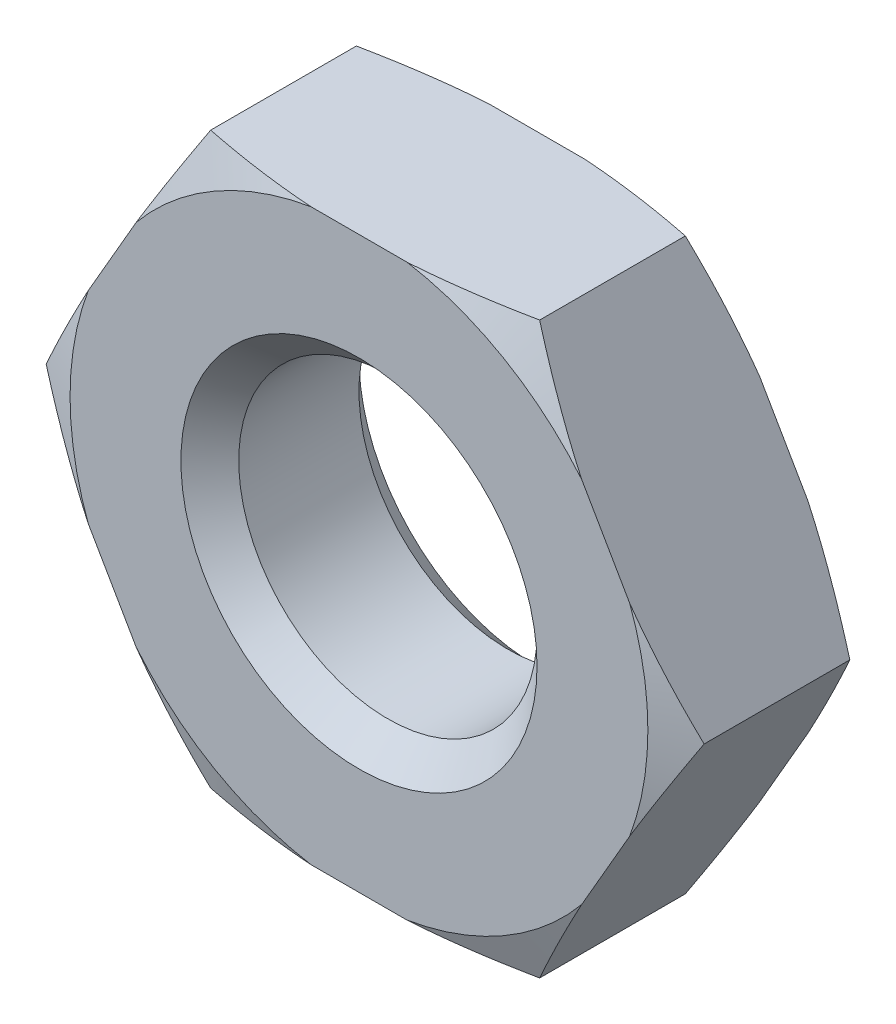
ISO-10303-21;
HEADER;
FILE_DESCRIPTION(('STEP AP214'),'2;1');
FILE_NAME('part.step','',(''),(''),'','','');
FILE_SCHEMA(('AUTOMOTIVE_DESIGN { 1 0 10303 214 1 1 1 1 }'));
ENDSEC;
DATA;
#1=APPLICATION_CONTEXT('core data for automotive mechanical design processes');
#2=APPLICATION_PROTOCOL_DEFINITION('international standard','automotive_design',2000,#1);
#3=PRODUCT_CONTEXT('',#1,'mechanical');
#4=PRODUCT('Part','Part','',(#3));
#5=PRODUCT_RELATED_PRODUCT_CATEGORY('part','',(#4));
#6=PRODUCT_DEFINITION_FORMATION('','',#4);
#7=PRODUCT_DEFINITION_CONTEXT('part definition',#1,'design');
#8=PRODUCT_DEFINITION('design','',#6,#7);
#9=PRODUCT_DEFINITION_SHAPE('','',#8);
#10=(LENGTH_UNIT() NAMED_UNIT(*) SI_UNIT(.MILLI.,.METRE.));
#11=(NAMED_UNIT(*) PLANE_ANGLE_UNIT() SI_UNIT($,.RADIAN.));
#12=(NAMED_UNIT(*) SI_UNIT($,.STERADIAN.) SOLID_ANGLE_UNIT());
#13=UNCERTAINTY_MEASURE_WITH_UNIT(LENGTH_MEASURE(1.E-05),#10,'distance_accuracy_value','');
#14=(GEOMETRIC_REPRESENTATION_CONTEXT(3) GLOBAL_UNCERTAINTY_ASSIGNED_CONTEXT((#13)) GLOBAL_UNIT_ASSIGNED_CONTEXT((#10,
#11,#12)) REPRESENTATION_CONTEXT('',''));
#15=CARTESIAN_POINT('',(0.,0.,0.));
#16=DIRECTION('',(0.,0.,1.));
#17=DIRECTION('',(1.,0.,0.));
#18=AXIS2_PLACEMENT_3D('',#15,#16,#17);
#19=CARTESIAN_POINT('',(0.,0.,4.77272727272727));
#20=DIRECTION('',(0.,0.,-1.));
#21=DIRECTION('',(1.,0.,0.));
#22=AXIS2_PLACEMENT_3D('',#19,#20,#21);
#23=CONICAL_SURFACE('',#22,8.67508026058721,1.18682389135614);
#24=CARTESIAN_POINT('',(4.6188,7.99999626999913,4.54545454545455));
#25=CARTESIAN_POINT('',(2.87668249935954,7.99999626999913,4.89738512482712));
#26=CARTESIAN_POINT('',(1.34673601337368,7.99999626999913,5.));
#27=(BOUNDED_CURVE() B_SPLINE_CURVE(2,(#24,#25,#26),.UNSPECIFIED.,.F.,
.F.) B_SPLINE_CURVE_WITH_KNOTS((3,3),(0.,3.30531398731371),
.UNSPECIFIED.) CURVE() GEOMETRIC_REPRESENTATION_ITEM() RATIONAL_B_SPLINE_CURVE((1.,
1.01827193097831,1.)) REPRESENTATION_ITEM(''));
#28=CARTESIAN_POINT('',(4.6188,7.99999626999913,4.54545454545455));
#29=VERTEX_POINT('',#28);
#30=CARTESIAN_POINT('',(1.34673601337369,7.99999626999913,5.));
#31=VERTEX_POINT('',#30);
#32=EDGE_CURVE('E10',#29,#31,#27,.T.);
#33=ORIENTED_EDGE('',*,*,#32,.T.);
#34=CARTESIAN_POINT('',(0.,0.,5.));
#35=DIRECTION('',(0.,0.,-1.));
#36=DIRECTION('',(1.,0.,0.));
#37=AXIS2_PLACEMENT_3D('',#34,#35,#36);
#38=CIRCLE('',#37,8.11256052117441);
#39=CARTESIAN_POINT('',(6.25483199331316,5.16630573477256,5.));
#40=VERTEX_POINT('',#39);
#41=EDGE_CURVE('E25',#31,#40,#38,.T.);
#42=ORIENTED_EDGE('',*,*,#41,.T.);
#43=CARTESIAN_POINT('',(6.25483199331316,5.16630573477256,5.));
#44=CARTESIAN_POINT('',(5.48985875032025,6.49127825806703,4.89738512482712));
#45=CARTESIAN_POINT('',(4.6188,7.99999626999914,4.54545454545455));
#46=(BOUNDED_CURVE() B_SPLINE_CURVE(2,(#43,#44,#45),.UNSPECIFIED.,.F.,
.F.) B_SPLINE_CURVE_WITH_KNOTS((3,3),(0.,3.30531398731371),
.UNSPECIFIED.) CURVE() GEOMETRIC_REPRESENTATION_ITEM() RATIONAL_B_SPLINE_CURVE((1.,
1.01827193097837,1.)) REPRESENTATION_ITEM(''));
#47=EDGE_CURVE('E273',#40,#29,#46,.T.);
#48=ORIENTED_EDGE('',*,*,#47,.T.);
#49=EDGE_LOOP('',(#33,#42,#48));
#50=FACE_BOUND('',#49,.T.);
#51=ADVANCED_FACE('F15',(#50),#23,.T.);
#52=CARTESIAN_POINT('',(0.,0.,4.77272727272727));
#53=DIRECTION('',(0.,0.,-1.));
#54=DIRECTION('',(1.,0.,0.));
#55=AXIS2_PLACEMENT_3D('',#52,#53,#54);
#56=CONICAL_SURFACE('',#55,8.67508026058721,1.18682389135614);
#57=CARTESIAN_POINT('',(-4.6188,7.99999626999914,4.54545454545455));
#58=CARTESIAN_POINT('',(-5.48985875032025,6.49127825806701,4.89738512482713));
#59=CARTESIAN_POINT('',(-6.25483199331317,5.16630573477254,5.));
#60=(BOUNDED_CURVE() B_SPLINE_CURVE(2,(#57,#58,#59),.UNSPECIFIED.,.F.,
.F.) B_SPLINE_CURVE_WITH_KNOTS((3,3),(0.,3.30531398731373),
.UNSPECIFIED.) CURVE() GEOMETRIC_REPRESENTATION_ITEM() RATIONAL_B_SPLINE_CURVE((1.,
1.01827193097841,1.)) REPRESENTATION_ITEM(''));
#61=CARTESIAN_POINT('',(-4.6188,7.99999626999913,4.54545454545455));
#62=VERTEX_POINT('',#61);
#63=CARTESIAN_POINT('',(-6.25483199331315,5.16630573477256,5.));
#64=VERTEX_POINT('',#63);
#65=EDGE_CURVE('E240',#62,#64,#60,.T.);
#66=ORIENTED_EDGE('',*,*,#65,.T.);
#67=CARTESIAN_POINT('',(0.,0.,5.));
#68=DIRECTION('',(0.,0.,-1.));
#69=DIRECTION('',(1.,0.,0.));
#70=AXIS2_PLACEMENT_3D('',#67,#68,#69);
#71=CIRCLE('',#70,8.11256052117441);
#72=CARTESIAN_POINT('',(-1.34673601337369,7.99999626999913,5.));
#73=VERTEX_POINT('',#72);
#74=EDGE_CURVE('E218',#64,#73,#71,.T.);
#75=ORIENTED_EDGE('',*,*,#74,.T.);
#76=CARTESIAN_POINT('',(-1.34673601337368,7.99999626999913,5.));
#77=CARTESIAN_POINT('',(-2.87668249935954,7.99999626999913,4.89738512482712));
#78=CARTESIAN_POINT('',(-4.6188,7.99999626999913,4.54545454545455));
#79=(BOUNDED_CURVE() B_SPLINE_CURVE(2,(#76,#77,#78),.UNSPECIFIED.,.F.,
.F.) B_SPLINE_CURVE_WITH_KNOTS((3,3),(0.,3.30531398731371),
.UNSPECIFIED.) CURVE() GEOMETRIC_REPRESENTATION_ITEM() RATIONAL_B_SPLINE_CURVE((1.,
1.01827193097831,1.)) REPRESENTATION_ITEM(''));
#80=EDGE_CURVE('E213',#73,#62,#79,.T.);
#81=ORIENTED_EDGE('',*,*,#80,.T.);
#82=EDGE_LOOP('',(#66,#75,#81));
#83=FACE_BOUND('',#82,.T.);
#84=ADVANCED_FACE('F471',(#83),#56,.T.);
#85=CARTESIAN_POINT('',(0.,0.,4.77272727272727));
#86=DIRECTION('',(0.,0.,-1.));
#87=DIRECTION('',(1.,0.,0.));
#88=AXIS2_PLACEMENT_3D('',#85,#86,#87);
#89=CONICAL_SURFACE('',#88,8.67508026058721,1.18682389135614);
#90=CARTESIAN_POINT('',(7.60156800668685,-2.83369053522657,5.));
#91=CARTESIAN_POINT('',(8.36654124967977,-1.50871801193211,4.89738512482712));
#92=CARTESIAN_POINT('',(9.2376,0.,4.54545454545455));
#93=(BOUNDED_CURVE() B_SPLINE_CURVE(2,(#90,#91,#92),.UNSPECIFIED.,.F.,
.F.) B_SPLINE_CURVE_WITH_KNOTS((3,3),(0.,3.30531398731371),
.UNSPECIFIED.) CURVE() GEOMETRIC_REPRESENTATION_ITEM() RATIONAL_B_SPLINE_CURVE((1.,
1.01827193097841,1.)) REPRESENTATION_ITEM(''));
#94=CARTESIAN_POINT('',(7.60156800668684,-2.83369053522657,5.));
#95=VERTEX_POINT('',#94);
#96=CARTESIAN_POINT('',(9.2376,0.,4.54545454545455));
#97=VERTEX_POINT('',#96);
#98=EDGE_CURVE('E219',#95,#97,#93,.T.);
#99=ORIENTED_EDGE('',*,*,#98,.T.);
#100=CARTESIAN_POINT('',(9.2376,0.,4.54545454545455));
#101=CARTESIAN_POINT('',(8.36654124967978,1.50871801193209,4.89738512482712));
#102=CARTESIAN_POINT('',(7.60156800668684,2.83369053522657,5.));
#103=(BOUNDED_CURVE() B_SPLINE_CURVE(2,(#100,#101,#102),.UNSPECIFIED.,.F.,
.F.) B_SPLINE_CURVE_WITH_KNOTS((3,3),(0.,3.30531398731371),
.UNSPECIFIED.) CURVE() GEOMETRIC_REPRESENTATION_ITEM() RATIONAL_B_SPLINE_CURVE((1.,
1.01827193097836,1.)) REPRESENTATION_ITEM(''));
#104=CARTESIAN_POINT('',(7.60156800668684,2.83369053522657,5.));
#105=VERTEX_POINT('',#104);
#106=EDGE_CURVE('E247',#97,#105,#103,.T.);
#107=ORIENTED_EDGE('',*,*,#106,.T.);
#108=CARTESIAN_POINT('',(0.,0.,5.));
#109=DIRECTION('',(0.,0.,-1.));
#110=DIRECTION('',(1.,0.,0.));
#111=AXIS2_PLACEMENT_3D('',#108,#109,#110);
#112=CIRCLE('',#111,8.11256052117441);
#113=EDGE_CURVE('E297',#105,#95,#112,.T.);
#114=ORIENTED_EDGE('',*,*,#113,.T.);
#115=EDGE_LOOP('',(#99,#107,#114));
#116=FACE_BOUND('',#115,.T.);
#117=ADVANCED_FACE('F477',(#116),#89,.T.);
#118=CARTESIAN_POINT('',(0.,0.,4.77272727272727));
#119=DIRECTION('',(0.,0.,-1.));
#120=DIRECTION('',(1.,0.,0.));
#121=AXIS2_PLACEMENT_3D('',#118,#119,#120);
#122=CONICAL_SURFACE('',#121,8.67508026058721,1.18682389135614);
#123=CARTESIAN_POINT('',(-9.2376,0.,4.54545454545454));
#124=CARTESIAN_POINT('',(-8.36654124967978,-1.50871801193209,4.89738512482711));
#125=CARTESIAN_POINT('',(-7.60156800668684,-2.83369053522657,5.));
#126=(BOUNDED_CURVE() B_SPLINE_CURVE(2,(#123,#124,#125),.UNSPECIFIED.,.F.,
.F.) B_SPLINE_CURVE_WITH_KNOTS((3,3),(0.,3.30531398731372),
.UNSPECIFIED.) CURVE() GEOMETRIC_REPRESENTATION_ITEM() RATIONAL_B_SPLINE_CURVE((1.,
1.01827193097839,1.)) REPRESENTATION_ITEM(''));
#127=CARTESIAN_POINT('',(-9.2376,0.,4.54545454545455));
#128=VERTEX_POINT('',#127);
#129=CARTESIAN_POINT('',(-7.60156800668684,-2.83369053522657,5.));
#130=VERTEX_POINT('',#129);
#131=EDGE_CURVE('E262',#128,#130,#126,.T.);
#132=ORIENTED_EDGE('',*,*,#131,.T.);
#133=CARTESIAN_POINT('',(0.,0.,5.));
#134=DIRECTION('',(0.,0.,-1.));
#135=DIRECTION('',(1.,0.,0.));
#136=AXIS2_PLACEMENT_3D('',#133,#134,#135);
#137=CIRCLE('',#136,8.11256052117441);
#138=CARTESIAN_POINT('',(-7.60156800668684,2.83369053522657,5.));
#139=VERTEX_POINT('',#138);
#140=EDGE_CURVE('E260',#130,#139,#137,.T.);
#141=ORIENTED_EDGE('',*,*,#140,.T.);
#142=CARTESIAN_POINT('',(-7.60156800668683,2.83369053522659,5.));
#143=CARTESIAN_POINT('',(-8.36654124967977,1.50871801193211,4.89738512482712));
#144=CARTESIAN_POINT('',(-9.2376,0.,4.54545454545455));
#145=(BOUNDED_CURVE() B_SPLINE_CURVE(2,(#142,#143,#144),.UNSPECIFIED.,.F.,
.F.) B_SPLINE_CURVE_WITH_KNOTS((3,3),(0.,3.30531398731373),
.UNSPECIFIED.) CURVE() GEOMETRIC_REPRESENTATION_ITEM() RATIONAL_B_SPLINE_CURVE((1.,
1.01827193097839,1.)) REPRESENTATION_ITEM(''));
#146=EDGE_CURVE('E263',#139,#128,#145,.T.);
#147=ORIENTED_EDGE('',*,*,#146,.T.);
#148=EDGE_LOOP('',(#132,#141,#147));
#149=FACE_BOUND('',#148,.T.);
#150=ADVANCED_FACE('F489',(#149),#122,.T.);
#151=CARTESIAN_POINT('',(0.,0.,4.77272727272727));
#152=DIRECTION('',(0.,0.,-1.));
#153=DIRECTION('',(1.,0.,0.));
#154=AXIS2_PLACEMENT_3D('',#151,#152,#153);
#155=CONICAL_SURFACE('',#154,8.67508026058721,1.18682389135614);
#156=CARTESIAN_POINT('',(1.3467360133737,-7.99999626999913,5.));
#157=CARTESIAN_POINT('',(2.87668249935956,-7.99999626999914,4.89738512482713));
#158=CARTESIAN_POINT('',(4.6188,-7.99999626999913,4.54545454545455));
#159=(BOUNDED_CURVE() B_SPLINE_CURVE(2,(#156,#157,#158),.UNSPECIFIED.,.F.,
.F.) B_SPLINE_CURVE_WITH_KNOTS((3,3),(0.,3.3053139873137),
.UNSPECIFIED.) CURVE() GEOMETRIC_REPRESENTATION_ITEM() RATIONAL_B_SPLINE_CURVE((1.,
1.0182719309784,1.)) REPRESENTATION_ITEM(''));
#160=CARTESIAN_POINT('',(1.34673601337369,-7.99999626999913,5.));
#161=VERTEX_POINT('',#160);
#162=CARTESIAN_POINT('',(4.6188,-7.99999626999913,4.54545454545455));
#163=VERTEX_POINT('',#162);
#164=EDGE_CURVE('E323',#161,#163,#159,.T.);
#165=ORIENTED_EDGE('',*,*,#164,.T.);
#166=CARTESIAN_POINT('',(4.6188,-7.99999626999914,4.54545454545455));
#167=CARTESIAN_POINT('',(5.48985875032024,-6.49127825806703,4.89738512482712));
#168=CARTESIAN_POINT('',(6.25483199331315,-5.16630573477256,5.));
#169=(BOUNDED_CURVE() B_SPLINE_CURVE(2,(#166,#167,#168),.UNSPECIFIED.,.F.,
.F.) B_SPLINE_CURVE_WITH_KNOTS((3,3),(0.,3.30531398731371),
.UNSPECIFIED.) CURVE() GEOMETRIC_REPRESENTATION_ITEM() RATIONAL_B_SPLINE_CURVE((1.,
1.01827193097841,1.)) REPRESENTATION_ITEM(''));
#170=CARTESIAN_POINT('',(6.25483199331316,-5.16630573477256,5.));
#171=VERTEX_POINT('',#170);
#172=EDGE_CURVE('E336',#163,#171,#169,.T.);
#173=ORIENTED_EDGE('',*,*,#172,.T.);
#174=CARTESIAN_POINT('',(0.,0.,5.));
#175=DIRECTION('',(0.,0.,-1.));
#176=DIRECTION('',(1.,0.,0.));
#177=AXIS2_PLACEMENT_3D('',#174,#175,#176);
#178=CIRCLE('',#177,8.11256052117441);
#179=EDGE_CURVE('E205',#171,#161,#178,.T.);
#180=ORIENTED_EDGE('',*,*,#179,.T.);
#181=EDGE_LOOP('',(#165,#173,#180));
#182=FACE_BOUND('',#181,.T.);
#183=ADVANCED_FACE('F397',(#182),#155,.T.);
#184=CARTESIAN_POINT('',(0.,0.,0.227272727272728));
#185=DIRECTION('',(0.,0.,1.));
#186=DIRECTION('',(1.,0.,0.));
#187=AXIS2_PLACEMENT_3D('',#184,#185,#186);
#188=CONICAL_SURFACE('',#187,8.67508026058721,1.18682389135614);
#189=CARTESIAN_POINT('',(4.6188,7.99999626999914,0.454545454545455));
#190=CARTESIAN_POINT('',(5.48985875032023,6.49127825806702,0.10261487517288));
#191=CARTESIAN_POINT('',(6.25483199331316,5.16630573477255,0.));
#192=(BOUNDED_CURVE() B_SPLINE_CURVE(2,(#189,#190,#191),.UNSPECIFIED.,.F.,
.F.) B_SPLINE_CURVE_WITH_KNOTS((3,3),(0.,3.30531398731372),
.UNSPECIFIED.) CURVE() GEOMETRIC_REPRESENTATION_ITEM() RATIONAL_B_SPLINE_CURVE((1.,
1.01827193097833,1.)) REPRESENTATION_ITEM(''));
#193=CARTESIAN_POINT('',(4.6188,7.99999626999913,0.454545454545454));
#194=VERTEX_POINT('',#193);
#195=CARTESIAN_POINT('',(6.25483199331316,5.16630573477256,0.));
#196=VERTEX_POINT('',#195);
#197=EDGE_CURVE('E197',#194,#196,#192,.T.);
#198=ORIENTED_EDGE('',*,*,#197,.T.);
#199=CARTESIAN_POINT('',(0.,0.,0.));
#200=DIRECTION('',(0.,0.,1.));
#201=DIRECTION('',(1.,0.,0.));
#202=AXIS2_PLACEMENT_3D('',#199,#200,#201);
#203=CIRCLE('',#202,8.11256052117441);
#204=CARTESIAN_POINT('',(1.34673601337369,7.99999626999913,0.));
#205=VERTEX_POINT('',#204);
#206=EDGE_CURVE('E206',#196,#205,#203,.T.);
#207=ORIENTED_EDGE('',*,*,#206,.T.);
#208=CARTESIAN_POINT('',(1.3467360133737,7.99999626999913,0.));
#209=CARTESIAN_POINT('',(2.87668249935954,7.99999626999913,0.102614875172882));
#210=CARTESIAN_POINT('',(4.6188,7.99999626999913,0.454545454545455));
#211=(BOUNDED_CURVE() B_SPLINE_CURVE(2,(#208,#209,#210),.UNSPECIFIED.,.F.,
.F.) B_SPLINE_CURVE_WITH_KNOTS((3,3),(0.,3.3053139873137),
.UNSPECIFIED.) CURVE() GEOMETRIC_REPRESENTATION_ITEM() RATIONAL_B_SPLINE_CURVE((1.,
1.01827193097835,1.)) REPRESENTATION_ITEM(''));
#212=EDGE_CURVE('E228',#205,#194,#211,.T.);
#213=ORIENTED_EDGE('',*,*,#212,.T.);
#214=EDGE_LOOP('',(#198,#207,#213));
#215=FACE_BOUND('',#214,.T.);
#216=ADVANCED_FACE('F493',(#215),#188,.T.);
#217=CARTESIAN_POINT('',(0.,0.,0.227272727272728));
#218=DIRECTION('',(0.,0.,1.));
#219=DIRECTION('',(1.,0.,0.));
#220=AXIS2_PLACEMENT_3D('',#217,#218,#219);
#221=CONICAL_SURFACE('',#220,8.67508026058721,1.18682389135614);
#222=CARTESIAN_POINT('',(-6.25483199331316,5.16630573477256,0.));
#223=CARTESIAN_POINT('',(-5.48985875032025,6.49127825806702,0.10261487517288));
#224=CARTESIAN_POINT('',(-4.6188,7.99999626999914,0.454545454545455));
#225=(BOUNDED_CURVE() B_SPLINE_CURVE(2,(#222,#223,#224),.UNSPECIFIED.,.F.,
.F.) B_SPLINE_CURVE_WITH_KNOTS((3,3),(0.,3.30531398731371),
.UNSPECIFIED.) CURVE() GEOMETRIC_REPRESENTATION_ITEM() RATIONAL_B_SPLINE_CURVE((1.,
1.01827193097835,1.)) REPRESENTATION_ITEM(''));
#226=CARTESIAN_POINT('',(-6.25483199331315,5.16630573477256,0.));
#227=VERTEX_POINT('',#226);
#228=CARTESIAN_POINT('',(-4.6188,7.99999626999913,0.454545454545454));
#229=VERTEX_POINT('',#228);
#230=EDGE_CURVE('E186',#227,#229,#225,.T.);
#231=ORIENTED_EDGE('',*,*,#230,.T.);
#232=CARTESIAN_POINT('',(-4.6188,7.99999626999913,0.454545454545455));
#233=CARTESIAN_POINT('',(-2.87668249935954,7.99999626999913,0.102614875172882));
#234=CARTESIAN_POINT('',(-1.3467360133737,7.99999626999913,0.));
#235=(BOUNDED_CURVE() B_SPLINE_CURVE(2,(#232,#233,#234),.UNSPECIFIED.,.F.,
.F.) B_SPLINE_CURVE_WITH_KNOTS((3,3),(0.,3.3053139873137),
.UNSPECIFIED.) CURVE() GEOMETRIC_REPRESENTATION_ITEM() RATIONAL_B_SPLINE_CURVE((1.,
1.01827193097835,1.)) REPRESENTATION_ITEM(''));
#236=CARTESIAN_POINT('',(-1.34673601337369,7.99999626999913,0.));
#237=VERTEX_POINT('',#236);
#238=EDGE_CURVE('E181',#229,#237,#235,.T.);
#239=ORIENTED_EDGE('',*,*,#238,.T.);
#240=CARTESIAN_POINT('',(0.,0.,0.));
#241=DIRECTION('',(0.,0.,1.));
#242=DIRECTION('',(1.,0.,0.));
#243=AXIS2_PLACEMENT_3D('',#240,#241,#242);
#244=CIRCLE('',#243,8.11256052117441);
#245=EDGE_CURVE('E187',#237,#227,#244,.T.);
#246=ORIENTED_EDGE('',*,*,#245,.T.);
#247=EDGE_LOOP('',(#231,#239,#246));
#248=FACE_BOUND('',#247,.T.);
#249=ADVANCED_FACE('F496',(#248),#221,.T.);
#250=CARTESIAN_POINT('',(0.,0.,0.227272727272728));
#251=DIRECTION('',(0.,0.,1.));
#252=DIRECTION('',(1.,0.,0.));
#253=AXIS2_PLACEMENT_3D('',#250,#251,#252);
#254=CONICAL_SURFACE('',#253,8.67508026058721,1.18682389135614);
#255=CARTESIAN_POINT('',(9.2376,0.,0.454545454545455));
#256=CARTESIAN_POINT('',(8.36654124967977,-1.5087180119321,0.102614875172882));
#257=CARTESIAN_POINT('',(7.60156800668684,-2.83369053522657,0.));
#258=(BOUNDED_CURVE() B_SPLINE_CURVE(2,(#255,#256,#257),.UNSPECIFIED.,.F.,
.F.) B_SPLINE_CURVE_WITH_KNOTS((3,3),(0.,3.30531398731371),
.UNSPECIFIED.) CURVE() GEOMETRIC_REPRESENTATION_ITEM() RATIONAL_B_SPLINE_CURVE((1.,
1.01827193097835,1.)) REPRESENTATION_ITEM(''));
#259=CARTESIAN_POINT('',(9.2376,0.,0.454545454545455));
#260=VERTEX_POINT('',#259);
#261=CARTESIAN_POINT('',(7.60156800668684,-2.83369053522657,0.));
#262=VERTEX_POINT('',#261);
#263=EDGE_CURVE('E188',#260,#262,#258,.T.);
#264=ORIENTED_EDGE('',*,*,#263,.T.);
#265=CARTESIAN_POINT('',(0.,0.,0.));
#266=DIRECTION('',(0.,0.,1.));
#267=DIRECTION('',(1.,0.,0.));
#268=AXIS2_PLACEMENT_3D('',#265,#266,#267);
#269=CIRCLE('',#268,8.11256052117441);
#270=CARTESIAN_POINT('',(7.60156800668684,2.83369053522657,0.));
#271=VERTEX_POINT('',#270);
#272=EDGE_CURVE('E196',#262,#271,#269,.T.);
#273=ORIENTED_EDGE('',*,*,#272,.T.);
#274=CARTESIAN_POINT('',(7.60156800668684,2.83369053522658,0.));
#275=CARTESIAN_POINT('',(8.36654124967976,1.50871801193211,0.10261487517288));
#276=CARTESIAN_POINT('',(9.2376,0.,0.454545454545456));
#277=(BOUNDED_CURVE() B_SPLINE_CURVE(2,(#274,#275,#276),.UNSPECIFIED.,.F.,
.F.) B_SPLINE_CURVE_WITH_KNOTS((3,3),(0.,3.30531398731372),
.UNSPECIFIED.) CURVE() GEOMETRIC_REPRESENTATION_ITEM() RATIONAL_B_SPLINE_CURVE((1.,
1.01827193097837,1.)) REPRESENTATION_ITEM(''));
#278=EDGE_CURVE('E160',#271,#260,#277,.T.);
#279=ORIENTED_EDGE('',*,*,#278,.T.);
#280=EDGE_LOOP('',(#264,#273,#279));
#281=FACE_BOUND('',#280,.T.);
#282=ADVANCED_FACE('F497',(#281),#254,.T.);
#283=CARTESIAN_POINT('',(0.,0.,0.227272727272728));
#284=DIRECTION('',(0.,0.,1.));
#285=DIRECTION('',(1.,0.,0.));
#286=AXIS2_PLACEMENT_3D('',#283,#284,#285);
#287=CONICAL_SURFACE('',#286,8.67508026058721,1.18682389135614);
#288=CARTESIAN_POINT('',(-7.60156800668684,-2.83369053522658,0.));
#289=CARTESIAN_POINT('',(-8.36654124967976,-1.50871801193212,0.102614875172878));
#290=CARTESIAN_POINT('',(-9.2376,0.,0.454545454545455));
#291=(BOUNDED_CURVE() B_SPLINE_CURVE(2,(#288,#289,#290),.UNSPECIFIED.,.F.,
.F.) B_SPLINE_CURVE_WITH_KNOTS((3,3),(0.,3.30531398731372),
.UNSPECIFIED.) CURVE() GEOMETRIC_REPRESENTATION_ITEM() RATIONAL_B_SPLINE_CURVE((1.,
1.01827193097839,1.)) REPRESENTATION_ITEM(''));
#292=CARTESIAN_POINT('',(-7.60156800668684,-2.83369053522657,0.));
#293=VERTEX_POINT('',#292);
#294=CARTESIAN_POINT('',(-9.2376,0.,0.454545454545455));
#295=VERTEX_POINT('',#294);
#296=EDGE_CURVE('E155',#293,#295,#291,.T.);
#297=ORIENTED_EDGE('',*,*,#296,.T.);
#298=CARTESIAN_POINT('',(-9.2376,0.,0.454545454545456));
#299=CARTESIAN_POINT('',(-8.36654124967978,1.5087180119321,0.102614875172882));
#300=CARTESIAN_POINT('',(-7.60156800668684,2.83369053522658,0.));
#301=(BOUNDED_CURVE() B_SPLINE_CURVE(2,(#298,#299,#300),.UNSPECIFIED.,.F.,
.F.) B_SPLINE_CURVE_WITH_KNOTS((3,3),(0.,3.30531398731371),
.UNSPECIFIED.) CURVE() GEOMETRIC_REPRESENTATION_ITEM() RATIONAL_B_SPLINE_CURVE((1.,
1.01827193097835,1.)) REPRESENTATION_ITEM(''));
#302=CARTESIAN_POINT('',(-7.60156800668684,2.83369053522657,0.));
#303=VERTEX_POINT('',#302);
#304=EDGE_CURVE('E161',#295,#303,#301,.T.);
#305=ORIENTED_EDGE('',*,*,#304,.T.);
#306=CARTESIAN_POINT('',(0.,0.,0.));
#307=DIRECTION('',(0.,0.,1.));
#308=DIRECTION('',(1.,0.,0.));
#309=AXIS2_PLACEMENT_3D('',#306,#307,#308);
#310=CIRCLE('',#309,8.11256052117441);
#311=EDGE_CURVE('E173',#303,#293,#310,.T.);
#312=ORIENTED_EDGE('',*,*,#311,.T.);
#313=EDGE_LOOP('',(#297,#305,#312));
#314=FACE_BOUND('',#313,.T.);
#315=ADVANCED_FACE('F500',(#314),#287,.T.);
#316=CARTESIAN_POINT('',(0.,0.,0.227272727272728));
#317=DIRECTION('',(0.,0.,1.));
#318=DIRECTION('',(1.,0.,0.));
#319=AXIS2_PLACEMENT_3D('',#316,#317,#318);
#320=CONICAL_SURFACE('',#319,8.67508026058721,1.18682389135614);
#321=CARTESIAN_POINT('',(4.6188,-7.99999626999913,0.454545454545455));
#322=CARTESIAN_POINT('',(2.87668249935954,-7.99999626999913,0.102614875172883));
#323=CARTESIAN_POINT('',(1.34673601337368,-7.99999626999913,0.));
#324=(BOUNDED_CURVE() B_SPLINE_CURVE(2,(#321,#322,#323),.UNSPECIFIED.,.F.,
.F.) B_SPLINE_CURVE_WITH_KNOTS((3,3),(0.,3.30531398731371),
.UNSPECIFIED.) CURVE() GEOMETRIC_REPRESENTATION_ITEM() RATIONAL_B_SPLINE_CURVE((1.,
1.01827193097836,1.)) REPRESENTATION_ITEM(''));
#325=CARTESIAN_POINT('',(4.6188,-7.99999626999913,0.454545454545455));
#326=VERTEX_POINT('',#325);
#327=CARTESIAN_POINT('',(1.34673601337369,-7.99999626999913,0.));
#328=VERTEX_POINT('',#327);
#329=EDGE_CURVE('E169',#326,#328,#324,.T.);
#330=ORIENTED_EDGE('',*,*,#329,.T.);
#331=CARTESIAN_POINT('',(0.,0.,0.));
#332=DIRECTION('',(0.,0.,1.));
#333=DIRECTION('',(1.,0.,0.));
#334=AXIS2_PLACEMENT_3D('',#331,#332,#333);
#335=CIRCLE('',#334,8.11256052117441);
#336=CARTESIAN_POINT('',(6.25483199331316,-5.16630573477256,0.));
#337=VERTEX_POINT('',#336);
#338=EDGE_CURVE('E96',#328,#337,#335,.T.);
#339=ORIENTED_EDGE('',*,*,#338,.T.);
#340=CARTESIAN_POINT('',(6.25483199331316,-5.16630573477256,0.));
#341=CARTESIAN_POINT('',(5.48985875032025,-6.49127825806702,0.102614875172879));
#342=CARTESIAN_POINT('',(4.6188,-7.99999626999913,0.454545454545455));
#343=(BOUNDED_CURVE() B_SPLINE_CURVE(2,(#340,#341,#342),.UNSPECIFIED.,.F.,
.F.) B_SPLINE_CURVE_WITH_KNOTS((3,3),(0.,3.30531398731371),
.UNSPECIFIED.) CURVE() GEOMETRIC_REPRESENTATION_ITEM() RATIONAL_B_SPLINE_CURVE((1.,
1.01827193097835,1.)) REPRESENTATION_ITEM(''));
#344=EDGE_CURVE('E108',#337,#326,#343,.T.);
#345=ORIENTED_EDGE('',*,*,#344,.T.);
#346=EDGE_LOOP('',(#330,#339,#345));
#347=FACE_BOUND('',#346,.T.);
#348=ADVANCED_FACE('F518',(#347),#320,.T.);
#349=CARTESIAN_POINT('',(0.,0.,0.227272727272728));
#350=DIRECTION('',(0.,0.,1.));
#351=DIRECTION('',(1.,0.,0.));
#352=AXIS2_PLACEMENT_3D('',#349,#350,#351);
#353=CONICAL_SURFACE('',#352,8.67508026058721,1.18682389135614);
#354=CARTESIAN_POINT('',(-1.34673601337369,-7.99999626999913,0.));
#355=CARTESIAN_POINT('',(-2.87668249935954,-7.99999626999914,0.102614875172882));
#356=CARTESIAN_POINT('',(-4.6188,-7.99999626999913,0.454545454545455));
#357=(BOUNDED_CURVE() B_SPLINE_CURVE(2,(#354,#355,#356),.UNSPECIFIED.,.F.,
.F.) B_SPLINE_CURVE_WITH_KNOTS((3,3),(0.,3.30531398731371),
.UNSPECIFIED.) CURVE() GEOMETRIC_REPRESENTATION_ITEM() RATIONAL_B_SPLINE_CURVE((1.,
1.01827193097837,1.)) REPRESENTATION_ITEM(''));
#358=CARTESIAN_POINT('',(-1.3467360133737,-7.99999626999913,0.));
#359=VERTEX_POINT('',#358);
#360=CARTESIAN_POINT('',(-4.6188,-7.99999626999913,0.454545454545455));
#361=VERTEX_POINT('',#360);
#362=EDGE_CURVE('E120',#359,#361,#357,.T.);
#363=ORIENTED_EDGE('',*,*,#362,.T.);
#364=CARTESIAN_POINT('',(-4.6188,-7.99999626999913,0.454545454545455));
#365=CARTESIAN_POINT('',(-5.48985875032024,-6.49127825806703,0.102614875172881));
#366=CARTESIAN_POINT('',(-6.25483199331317,-5.16630573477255,0.));
#367=(BOUNDED_CURVE() B_SPLINE_CURVE(2,(#364,#365,#366),.UNSPECIFIED.,.F.,
.F.) B_SPLINE_CURVE_WITH_KNOTS((3,3),(0.,3.30531398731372),
.UNSPECIFIED.) CURVE() GEOMETRIC_REPRESENTATION_ITEM() RATIONAL_B_SPLINE_CURVE((1.,
1.01827193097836,1.)) REPRESENTATION_ITEM(''));
#368=CARTESIAN_POINT('',(-6.25483199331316,-5.16630573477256,0.));
#369=VERTEX_POINT('',#368);
#370=EDGE_CURVE('E123',#361,#369,#367,.T.);
#371=ORIENTED_EDGE('',*,*,#370,.T.);
#372=CARTESIAN_POINT('',(0.,0.,0.));
#373=DIRECTION('',(0.,0.,1.));
#374=DIRECTION('',(1.,0.,0.));
#375=AXIS2_PLACEMENT_3D('',#372,#373,#374);
#376=CIRCLE('',#375,8.11256052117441);
#377=EDGE_CURVE('E117',#369,#359,#376,.T.);
#378=ORIENTED_EDGE('',*,*,#377,.T.);
#379=EDGE_LOOP('',(#363,#371,#378));
#380=FACE_BOUND('',#379,.T.);
#381=ADVANCED_FACE('F119',(#380),#353,.T.);
#382=CARTESIAN_POINT('',(0.,0.,4.77272727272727));
#383=DIRECTION('',(0.,0.,-1.));
#384=DIRECTION('',(1.,0.,0.));
#385=AXIS2_PLACEMENT_3D('',#382,#383,#384);
#386=CONICAL_SURFACE('',#385,8.67508026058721,1.18682389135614);
#387=CARTESIAN_POINT('',(-4.6188,-7.99999626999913,4.54545454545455));
#388=CARTESIAN_POINT('',(-2.87668249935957,-7.99999626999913,4.89738512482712));
#389=CARTESIAN_POINT('',(-1.3467360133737,-7.99999626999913,5.));
#390=(BOUNDED_CURVE() B_SPLINE_CURVE(2,(#387,#388,#389),.UNSPECIFIED.,.F.,
.F.) B_SPLINE_CURVE_WITH_KNOTS((3,3),(0.,3.3053139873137),
.UNSPECIFIED.) CURVE() GEOMETRIC_REPRESENTATION_ITEM() RATIONAL_B_SPLINE_CURVE((1.,
1.01827193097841,1.)) REPRESENTATION_ITEM(''));
#391=CARTESIAN_POINT('',(-4.6188,-7.99999626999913,4.54545454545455));
#392=VERTEX_POINT('',#391);
#393=CARTESIAN_POINT('',(-1.3467360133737,-7.99999626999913,5.));
#394=VERTEX_POINT('',#393);
#395=EDGE_CURVE('E126',#392,#394,#390,.T.);
#396=ORIENTED_EDGE('',*,*,#395,.T.);
#397=CARTESIAN_POINT('',(0.,0.,5.));
#398=DIRECTION('',(0.,0.,-1.));
#399=DIRECTION('',(1.,0.,0.));
#400=AXIS2_PLACEMENT_3D('',#397,#398,#399);
#401=CIRCLE('',#400,8.11256052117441);
#402=CARTESIAN_POINT('',(-6.25483199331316,-5.16630573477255,5.));
#403=VERTEX_POINT('',#402);
#404=EDGE_CURVE('E248',#394,#403,#401,.T.);
#405=ORIENTED_EDGE('',*,*,#404,.T.);
#406=CARTESIAN_POINT('',(-6.25483199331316,-5.16630573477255,5.));
#407=CARTESIAN_POINT('',(-5.48985875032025,-6.49127825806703,4.89738512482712));
#408=CARTESIAN_POINT('',(-4.6188,-7.99999626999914,4.54545454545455));
#409=(BOUNDED_CURVE() B_SPLINE_CURVE(2,(#406,#407,#408),.UNSPECIFIED.,.F.,
.F.) B_SPLINE_CURVE_WITH_KNOTS((3,3),(0.,3.30531398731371),
.UNSPECIFIED.) CURVE() GEOMETRIC_REPRESENTATION_ITEM() RATIONAL_B_SPLINE_CURVE((1.,
1.01827193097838,1.)) REPRESENTATION_ITEM(''));
#410=EDGE_CURVE('E226',#403,#392,#409,.T.);
#411=ORIENTED_EDGE('',*,*,#410,.T.);
#412=EDGE_LOOP('',(#396,#405,#411));
#413=FACE_BOUND('',#412,.T.);
#414=ADVANCED_FACE('F407',(#413),#386,.T.);
#415=CARTESIAN_POINT('',(0.,0.,4.5940625));
#416=DIRECTION('',(0.,0.,1.));
#417=DIRECTION('',(1.,0.,0.));
#418=AXIS2_PLACEMENT_3D('',#415,#416,#417);
#419=CONICAL_SURFACE('',#418,4.5940625,0.785398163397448);
#420=CARTESIAN_POINT('',(0.,0.,4.188125));
#421=DIRECTION('',(0.,0.,1.));
#422=DIRECTION('',(1.,0.,0.));
#423=AXIS2_PLACEMENT_3D('',#420,#421,#422);
#424=CIRCLE('',#423,4.188125);
#425=CARTESIAN_POINT('',(4.188125,0.,4.188125));
#426=VERTEX_POINT('',#425);
#427=EDGE_CURVE('E227',#426,#426,#424,.T.);
#428=ORIENTED_EDGE('',*,*,#427,.F.);
#429=EDGE_LOOP('',(#428));
#430=FACE_BOUND('',#429,.T.);
#431=CARTESIAN_POINT('',(0.,0.,5.));
#432=DIRECTION('',(0.,0.,1.));
#433=DIRECTION('',(1.,0.,0.));
#434=AXIS2_PLACEMENT_3D('',#431,#432,#433);
#435=CIRCLE('',#434,5.);
#436=CARTESIAN_POINT('',(5.,0.,5.));
#437=VERTEX_POINT('',#436);
#438=EDGE_CURVE('E220',#437,#437,#435,.T.);
#439=ORIENTED_EDGE('',*,*,#438,.T.);
#440=EDGE_LOOP('',(#439));
#441=FACE_BOUND('',#440,.T.);
#442=ADVANCED_FACE('F455',(#430,#441),#419,.F.);
#443=CARTESIAN_POINT('',(0.,0.,2.5));
#444=DIRECTION('',(0.,0.,-1.));
#445=DIRECTION('',(1.,0.,0.));
#446=AXIS2_PLACEMENT_3D('',#443,#444,#445);
#447=CYLINDRICAL_SURFACE('',#446,4.188125);
#448=CARTESIAN_POINT('',(0.,0.,0.811875));
#449=DIRECTION('',(0.,0.,1.));
#450=DIRECTION('',(1.,0.,0.));
#451=AXIS2_PLACEMENT_3D('',#448,#449,#450);
#452=CIRCLE('',#451,4.188125);
#453=CARTESIAN_POINT('',(4.188125,0.,0.811875));
#454=VERTEX_POINT('',#453);
#455=EDGE_CURVE('E138',#454,#454,#452,.T.);
#456=ORIENTED_EDGE('',*,*,#455,.F.);
#457=EDGE_LOOP('',(#456));
#458=FACE_BOUND('',#457,.T.);
#459=ORIENTED_EDGE('',*,*,#427,.T.);
#460=EDGE_LOOP('',(#459));
#461=FACE_BOUND('',#460,.T.);
#462=ADVANCED_FACE('F457',(#458,#461),#447,.F.);
#463=CARTESIAN_POINT('',(0.,0.,0.4059375));
#464=DIRECTION('',(0.,0.,-1.));
#465=DIRECTION('',(1.,0.,0.));
#466=AXIS2_PLACEMENT_3D('',#463,#464,#465);
#467=CONICAL_SURFACE('',#466,4.5940625,0.785398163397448);
#468=CARTESIAN_POINT('',(0.,0.,0.));
#469=DIRECTION('',(0.,0.,-1.));
#470=DIRECTION('',(1.,0.,0.));
#471=AXIS2_PLACEMENT_3D('',#468,#469,#470);
#472=CIRCLE('',#471,5.);
#473=CARTESIAN_POINT('',(5.,0.,0.));
#474=VERTEX_POINT('',#473);
#475=EDGE_CURVE('E142',#474,#474,#472,.T.);
#476=ORIENTED_EDGE('',*,*,#475,.T.);
#477=EDGE_LOOP('',(#476));
#478=FACE_BOUND('',#477,.T.);
#479=ORIENTED_EDGE('',*,*,#455,.T.);
#480=EDGE_LOOP('',(#479));
#481=FACE_BOUND('',#480,.T.);
#482=ADVANCED_FACE('F465',(#478,#481),#467,.F.);
#483=CARTESIAN_POINT('',(0.,-7.99999626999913,0.));
#484=DIRECTION('',(0.,-1.,0.));
#485=DIRECTION('',(1.,0.,0.));
#486=AXIS2_PLACEMENT_3D('',#483,#484,#485);
#487=PLANE('',#486);
#488=ORIENTED_EDGE('',*,*,#395,.F.);
#489=DIRECTION('',(0.,0.,1.));
#490=VECTOR('',#489,1.);
#491=CARTESIAN_POINT('',(-4.6188,-7.99999626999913,0.));
#492=LINE('',#491,#490);
#493=EDGE_CURVE('E135',#361,#392,#492,.T.);
#494=ORIENTED_EDGE('',*,*,#493,.F.);
#495=ORIENTED_EDGE('',*,*,#362,.F.);
#496=DIRECTION('',(1.,0.,0.));
#497=VECTOR('',#496,1.);
#498=CARTESIAN_POINT('',(-4.6188,-7.99999626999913,0.));
#499=LINE('',#498,#497);
#500=EDGE_CURVE('E133',#359,#328,#499,.T.);
#501=ORIENTED_EDGE('',*,*,#500,.T.);
#502=ORIENTED_EDGE('',*,*,#329,.F.);
#503=DIRECTION('',(0.,0.,1.));
#504=VECTOR('',#503,1.);
#505=CARTESIAN_POINT('',(4.6188,-7.99999626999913,0.));
#506=LINE('',#505,#504);
#507=EDGE_CURVE('E139',#326,#163,#506,.T.);
#508=ORIENTED_EDGE('',*,*,#507,.T.);
#509=ORIENTED_EDGE('',*,*,#164,.F.);
#510=DIRECTION('',(-1.,0.,0.));
#511=VECTOR('',#510,1.);
#512=CARTESIAN_POINT('',(-4.6188,-7.99999626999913,5.));
#513=LINE('',#512,#511);
#514=EDGE_CURVE('E145',#161,#394,#513,.T.);
#515=ORIENTED_EDGE('',*,*,#514,.T.);
#516=EDGE_LOOP('',(#488,#494,#495,#501,#502,#508,#509,#515));
#517=FACE_BOUND('',#516,.T.);
#518=ADVANCED_FACE('F131',(#517),#487,.T.);
#519=CARTESIAN_POINT('',(-6.9282,-3.99999813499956,0.));
#520=DIRECTION('',(-0.866025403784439,-0.5,0.));
#521=DIRECTION('',(0.5,-0.866025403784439,0.));
#522=AXIS2_PLACEMENT_3D('',#519,#520,#521);
#523=PLANE('',#522);
#524=ORIENTED_EDGE('',*,*,#410,.F.);
#525=DIRECTION('',(-0.5,0.866025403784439,0.));
#526=VECTOR('',#525,1.);
#527=CARTESIAN_POINT('',(-9.2376,0.,5.));
#528=LINE('',#527,#526);
#529=EDGE_CURVE('E154',#403,#130,#528,.T.);
#530=ORIENTED_EDGE('',*,*,#529,.T.);
#531=ORIENTED_EDGE('',*,*,#131,.F.);
#532=DIRECTION('',(0.,0.,1.));
#533=VECTOR('',#532,1.);
#534=CARTESIAN_POINT('',(-9.2376,0.,0.));
#535=LINE('',#534,#533);
#536=EDGE_CURVE('E180',#295,#128,#535,.T.);
#537=ORIENTED_EDGE('',*,*,#536,.F.);
#538=ORIENTED_EDGE('',*,*,#296,.F.);
#539=DIRECTION('',(0.5,-0.866025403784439,0.));
#540=VECTOR('',#539,1.);
#541=CARTESIAN_POINT('',(-9.2376,0.,0.));
#542=LINE('',#541,#540);
#543=EDGE_CURVE('E284',#293,#369,#542,.T.);
#544=ORIENTED_EDGE('',*,*,#543,.T.);
#545=ORIENTED_EDGE('',*,*,#370,.F.);
#546=ORIENTED_EDGE('',*,*,#493,.T.);
#547=EDGE_LOOP('',(#524,#530,#531,#537,#538,#544,#545,#546));
#548=FACE_BOUND('',#547,.T.);
#549=ADVANCED_FACE('F409',(#548),#523,.T.);
#550=CARTESIAN_POINT('',(-6.9282,3.99999813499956,0.));
#551=DIRECTION('',(-0.866025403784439,0.5,0.));
#552=DIRECTION('',(-0.5,-0.866025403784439,0.));
#553=AXIS2_PLACEMENT_3D('',#550,#551,#552);
#554=PLANE('',#553);
#555=ORIENTED_EDGE('',*,*,#146,.F.);
#556=DIRECTION('',(0.5,0.866025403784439,0.));
#557=VECTOR('',#556,1.);
#558=CARTESIAN_POINT('',(-4.6188,7.99999626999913,5.));
#559=LINE('',#558,#557);
#560=EDGE_CURVE('E294',#139,#64,#559,.T.);
#561=ORIENTED_EDGE('',*,*,#560,.T.);
#562=ORIENTED_EDGE('',*,*,#65,.F.);
#563=DIRECTION('',(0.,0.,1.));
#564=VECTOR('',#563,1.);
#565=CARTESIAN_POINT('',(-4.6188,7.99999626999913,0.));
#566=LINE('',#565,#564);
#567=EDGE_CURVE('E167',#229,#62,#566,.T.);
#568=ORIENTED_EDGE('',*,*,#567,.F.);
#569=ORIENTED_EDGE('',*,*,#230,.F.);
#570=DIRECTION('',(-0.5,-0.866025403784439,0.));
#571=VECTOR('',#570,1.);
#572=CARTESIAN_POINT('',(-4.6188,7.99999626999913,0.));
#573=LINE('',#572,#571);
#574=EDGE_CURVE('E272',#227,#303,#573,.T.);
#575=ORIENTED_EDGE('',*,*,#574,.T.);
#576=ORIENTED_EDGE('',*,*,#304,.F.);
#577=ORIENTED_EDGE('',*,*,#536,.T.);
#578=EDGE_LOOP('',(#555,#561,#562,#568,#569,#575,#576,#577));
#579=FACE_BOUND('',#578,.T.);
#580=ADVANCED_FACE('F482',(#579),#554,.T.);
#581=CARTESIAN_POINT('',(0.,7.99999626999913,0.));
#582=DIRECTION('',(0.,1.,0.));
#583=DIRECTION('',(-1.,0.,0.));
#584=AXIS2_PLACEMENT_3D('',#581,#582,#583);
#585=PLANE('',#584);
#586=ORIENTED_EDGE('',*,*,#80,.F.);
#587=DIRECTION('',(1.,0.,0.));
#588=VECTOR('',#587,1.);
#589=CARTESIAN_POINT('',(4.6188,7.99999626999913,5.));
#590=LINE('',#589,#588);
#591=EDGE_CURVE('E174',#73,#31,#590,.T.);
#592=ORIENTED_EDGE('',*,*,#591,.T.);
#593=ORIENTED_EDGE('',*,*,#32,.F.);
#594=DIRECTION('',(0.,0.,1.));
#595=VECTOR('',#594,1.);
#596=CARTESIAN_POINT('',(4.6188,7.99999626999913,0.));
#597=LINE('',#596,#595);
#598=EDGE_CURVE('E259',#194,#29,#597,.T.);
#599=ORIENTED_EDGE('',*,*,#598,.F.);
#600=ORIENTED_EDGE('',*,*,#212,.F.);
#601=DIRECTION('',(-1.,0.,0.));
#602=VECTOR('',#601,1.);
#603=CARTESIAN_POINT('',(4.6188,7.99999626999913,0.));
#604=LINE('',#603,#602);
#605=EDGE_CURVE('E19',#205,#237,#604,.T.);
#606=ORIENTED_EDGE('',*,*,#605,.T.);
#607=ORIENTED_EDGE('',*,*,#238,.F.);
#608=ORIENTED_EDGE('',*,*,#567,.T.);
#609=EDGE_LOOP('',(#586,#592,#593,#599,#600,#606,#607,#608));
#610=FACE_BOUND('',#609,.T.);
#611=ADVANCED_FACE('F421',(#610),#585,.T.);
#612=CARTESIAN_POINT('',(0.,0.,0.));
#613=DIRECTION('',(0.,0.,1.));
#614=DIRECTION('',(1.,0.,0.));
#615=AXIS2_PLACEMENT_3D('',#612,#613,#614);
#616=PLANE('',#615);
#617=ORIENTED_EDGE('',*,*,#475,.F.);
#618=EDGE_LOOP('',(#617));
#619=FACE_BOUND('',#618,.T.);
#620=ORIENTED_EDGE('',*,*,#377,.F.);
#621=ORIENTED_EDGE('',*,*,#543,.F.);
#622=ORIENTED_EDGE('',*,*,#311,.F.);
#623=ORIENTED_EDGE('',*,*,#574,.F.);
#624=ORIENTED_EDGE('',*,*,#245,.F.);
#625=ORIENTED_EDGE('',*,*,#605,.F.);
#626=ORIENTED_EDGE('',*,*,#206,.F.);
#627=DIRECTION('',(-0.5,0.866025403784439,0.));
#628=VECTOR('',#627,1.);
#629=CARTESIAN_POINT('',(9.2376,0.,0.));
#630=LINE('',#629,#628);
#631=EDGE_CURVE('E291',#271,#196,#630,.T.);
#632=ORIENTED_EDGE('',*,*,#631,.F.);
#633=ORIENTED_EDGE('',*,*,#272,.F.);
#634=DIRECTION('',(0.5,0.866025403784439,0.));
#635=VECTOR('',#634,1.);
#636=CARTESIAN_POINT('',(4.6188,-7.99999626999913,0.));
#637=LINE('',#636,#635);
#638=EDGE_CURVE('E162',#337,#262,#637,.T.);
#639=ORIENTED_EDGE('',*,*,#638,.F.);
#640=ORIENTED_EDGE('',*,*,#338,.F.);
#641=ORIENTED_EDGE('',*,*,#500,.F.);
#642=EDGE_LOOP('',(#620,#621,#622,#623,#624,#625,#626,#632,#633,#639,#640,#641));
#643=FACE_BOUND('',#642,.T.);
#644=ADVANCED_FACE('F137',(#619,#643),#616,.F.);
#645=CARTESIAN_POINT('',(6.9282,-3.99999813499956,0.));
#646=DIRECTION('',(0.866025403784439,-0.5,0.));
#647=DIRECTION('',(0.5,0.866025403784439,0.));
#648=AXIS2_PLACEMENT_3D('',#645,#646,#647);
#649=PLANE('',#648);
#650=ORIENTED_EDGE('',*,*,#172,.F.);
#651=ORIENTED_EDGE('',*,*,#507,.F.);
#652=ORIENTED_EDGE('',*,*,#344,.F.);
#653=ORIENTED_EDGE('',*,*,#638,.T.);
#654=ORIENTED_EDGE('',*,*,#263,.F.);
#655=DIRECTION('',(0.,0.,1.));
#656=VECTOR('',#655,1.);
#657=CARTESIAN_POINT('',(9.2376,0.,0.));
#658=LINE('',#657,#656);
#659=EDGE_CURVE('E168',#260,#97,#658,.T.);
#660=ORIENTED_EDGE('',*,*,#659,.T.);
#661=ORIENTED_EDGE('',*,*,#98,.F.);
#662=DIRECTION('',(-0.5,-0.866025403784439,0.));
#663=VECTOR('',#662,1.);
#664=CARTESIAN_POINT('',(4.6188,-7.99999626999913,5.));
#665=LINE('',#664,#663);
#666=EDGE_CURVE('E212',#95,#171,#665,.T.);
#667=ORIENTED_EDGE('',*,*,#666,.T.);
#668=EDGE_LOOP('',(#650,#651,#652,#653,#654,#660,#661,#667));
#669=FACE_BOUND('',#668,.T.);
#670=ADVANCED_FACE('F481',(#669),#649,.T.);
#671=CARTESIAN_POINT('',(6.9282,3.99999813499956,0.));
#672=DIRECTION('',(0.866025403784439,0.5,0.));
#673=DIRECTION('',(-0.5,0.866025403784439,0.));
#674=AXIS2_PLACEMENT_3D('',#671,#672,#673);
#675=PLANE('',#674);
#676=ORIENTED_EDGE('',*,*,#106,.F.);
#677=ORIENTED_EDGE('',*,*,#659,.F.);
#678=ORIENTED_EDGE('',*,*,#278,.F.);
#679=ORIENTED_EDGE('',*,*,#631,.T.);
#680=ORIENTED_EDGE('',*,*,#197,.F.);
#681=ORIENTED_EDGE('',*,*,#598,.T.);
#682=ORIENTED_EDGE('',*,*,#47,.F.);
#683=DIRECTION('',(0.5,-0.866025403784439,0.));
#684=VECTOR('',#683,1.);
#685=CARTESIAN_POINT('',(9.2376,0.,5.));
#686=LINE('',#685,#684);
#687=EDGE_CURVE('E256',#40,#105,#686,.T.);
#688=ORIENTED_EDGE('',*,*,#687,.T.);
#689=EDGE_LOOP('',(#676,#677,#678,#679,#680,#681,#682,#688));
#690=FACE_BOUND('',#689,.T.);
#691=ADVANCED_FACE('F17',(#690),#675,.T.);
#692=CARTESIAN_POINT('',(0.,0.,5.));
#693=DIRECTION('',(0.,0.,1.));
#694=DIRECTION('',(1.,0.,0.));
#695=AXIS2_PLACEMENT_3D('',#692,#693,#694);
#696=PLANE('',#695);
#697=ORIENTED_EDGE('',*,*,#404,.F.);
#698=ORIENTED_EDGE('',*,*,#514,.F.);
#699=ORIENTED_EDGE('',*,*,#179,.F.);
#700=ORIENTED_EDGE('',*,*,#666,.F.);
#701=ORIENTED_EDGE('',*,*,#113,.F.);
#702=ORIENTED_EDGE('',*,*,#687,.F.);
#703=ORIENTED_EDGE('',*,*,#41,.F.);
#704=ORIENTED_EDGE('',*,*,#591,.F.);
#705=ORIENTED_EDGE('',*,*,#74,.F.);
#706=ORIENTED_EDGE('',*,*,#560,.F.);
#707=ORIENTED_EDGE('',*,*,#140,.F.);
#708=ORIENTED_EDGE('',*,*,#529,.F.);
#709=EDGE_LOOP('',(#697,#698,#699,#700,#701,#702,#703,#704,#705,#706,#707,#708));
#710=FACE_BOUND('',#709,.T.);
#711=ORIENTED_EDGE('',*,*,#438,.F.);
#712=EDGE_LOOP('',(#711));
#713=FACE_BOUND('',#712,.T.);
#714=ADVANCED_FACE('F402',(#710,#713),#696,.T.);
#715=CLOSED_SHELL('',(#51,#84,#117,#150,#183,#216,#249,#282,#315,#348,#381,#414,#442,#462,#482,
#518,#549,#580,#611,#644,#670,#691,#714));
#716=MANIFOLD_SOLID_BREP('B1',#715);
#717=ADVANCED_BREP_SHAPE_REPRESENTATION('',(#18,#716),#14);
#718=SHAPE_DEFINITION_REPRESENTATION(#9,#717);
ENDSEC;
END-ISO-10303-21;
